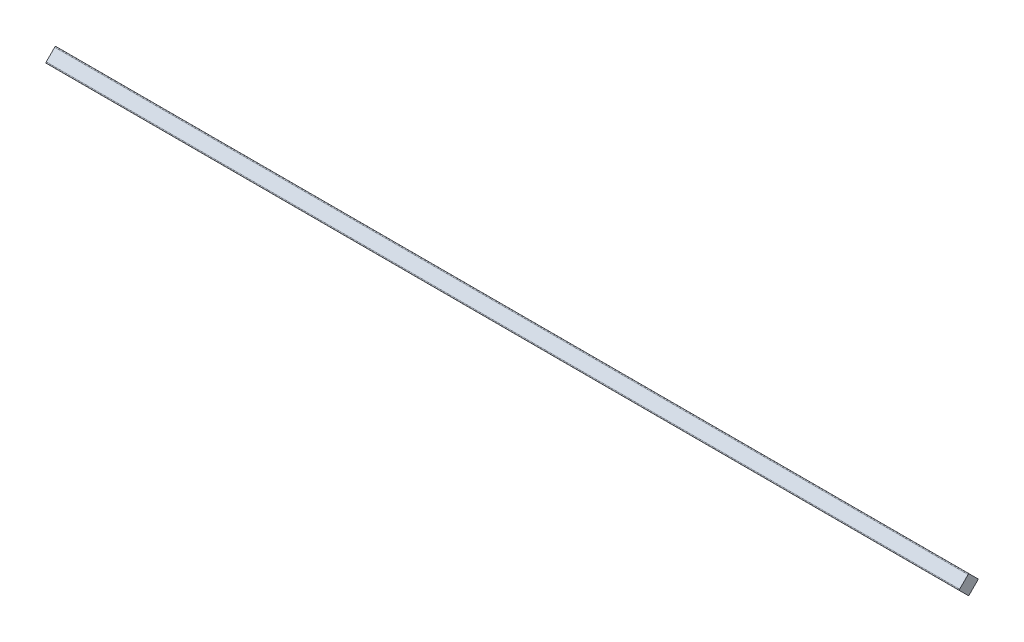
from build123d import *

# Parameters (mm, degrees)
EXTRUDE_L_NGD_DEPTH     = 3000
FILLET_KANTAVRUNDNING_R = 3


with BuildPart() as part:
    # Sketch1 → Extrude l_ngd (new body)
    with BuildSketch(Plane(origin=(0, 0, 0), x_dir=(0, 0, -1), z_dir=(1, 0, 0))):
        Polygon((0, 31.819805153), (-31.819805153, 0), (0, -31.819805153), (31.819805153, 0), align=None)
    extrude(amount=EXTRUDE_L_NGD_DEPTH)

    # Fillet kantavrundning
    fillet_kantavrundning_edges = [part.edges().sort_by_distance(p)[0] for p in [
        (1500, 0, -31.819805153),
        (1500, -31.819805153, 0),
        (1500, 0, 31.819805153),
        (1500, 31.819805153, 0),
    ]]
    fillet(fillet_kantavrundning_edges, radius=FILLET_KANTAVRUNDNING_R)


solid = part.part
